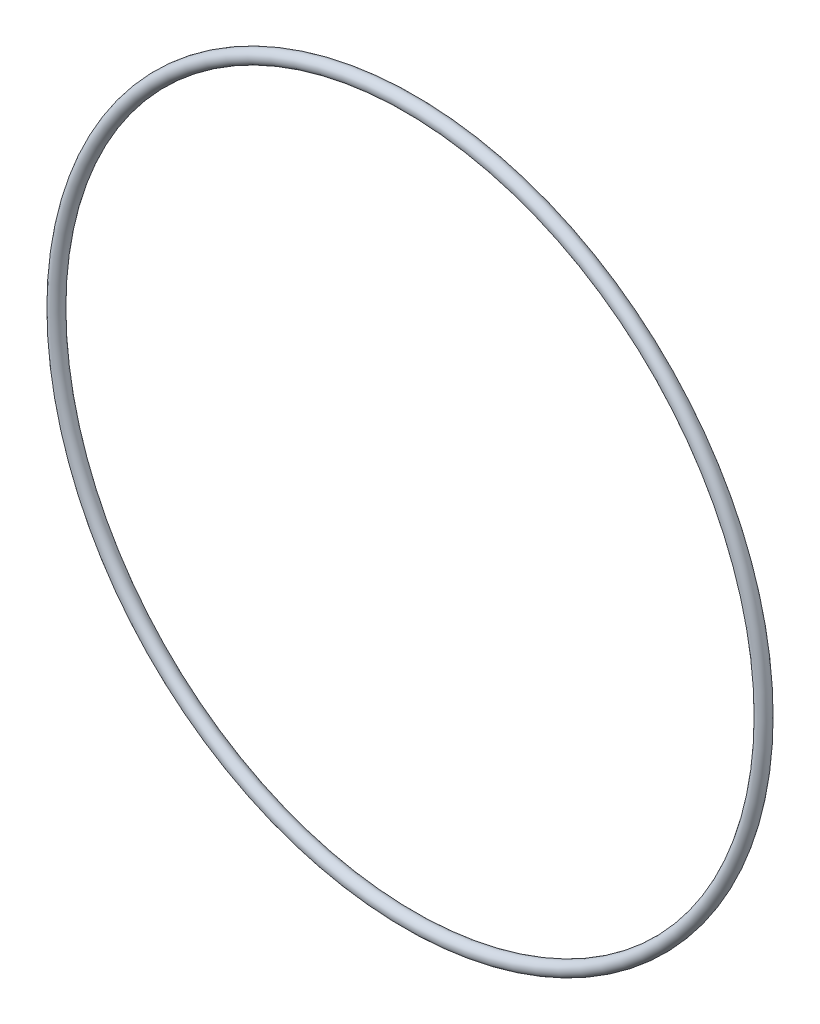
ISO-10303-21;
HEADER;
FILE_DESCRIPTION(('STEP AP214'),'2;1');
FILE_NAME('part.step','',(''),(''),'','','');
FILE_SCHEMA(('AUTOMOTIVE_DESIGN { 1 0 10303 214 1 1 1 1 }'));
ENDSEC;
DATA;
#1=APPLICATION_CONTEXT('core data for automotive mechanical design processes');
#2=APPLICATION_PROTOCOL_DEFINITION('international standard','automotive_design',2000,#1);
#3=PRODUCT_CONTEXT('',#1,'mechanical');
#4=PRODUCT('Part','Part','',(#3));
#5=PRODUCT_RELATED_PRODUCT_CATEGORY('part','',(#4));
#6=PRODUCT_DEFINITION_FORMATION('','',#4);
#7=PRODUCT_DEFINITION_CONTEXT('part definition',#1,'design');
#8=PRODUCT_DEFINITION('design','',#6,#7);
#9=PRODUCT_DEFINITION_SHAPE('','',#8);
#10=(LENGTH_UNIT() NAMED_UNIT(*) SI_UNIT(.MILLI.,.METRE.));
#11=(NAMED_UNIT(*) PLANE_ANGLE_UNIT() SI_UNIT($,.RADIAN.));
#12=(NAMED_UNIT(*) SI_UNIT($,.STERADIAN.) SOLID_ANGLE_UNIT());
#13=UNCERTAINTY_MEASURE_WITH_UNIT(LENGTH_MEASURE(1.E-05),#10,'distance_accuracy_value','');
#14=(GEOMETRIC_REPRESENTATION_CONTEXT(3) GLOBAL_UNCERTAINTY_ASSIGNED_CONTEXT((#13)) GLOBAL_UNIT_ASSIGNED_CONTEXT((#10,
#11,#12)) REPRESENTATION_CONTEXT('',''));
#15=CARTESIAN_POINT('',(0.,0.,0.));
#16=DIRECTION('',(0.,0.,1.));
#17=DIRECTION('',(1.,0.,0.));
#18=AXIS2_PLACEMENT_3D('',#15,#16,#17);
#19=CARTESIAN_POINT('',(0.,0.,0.));
#20=DIRECTION('',(0.,0.,-1.));
#21=DIRECTION('',(-1.,0.,0.));
#22=AXIS2_PLACEMENT_3D('',#19,#20,#21);
#23=TOROIDAL_SURFACE('',#22,83.47075,1.5875);
#24=CARTESIAN_POINT('',(-85.05825,0.,0.));
#25=VERTEX_POINT('',#24);
#26=VERTEX_LOOP('',#25);
#27=FACE_BOUND('',#26,.T.);
#28=ADVANCED_FACE('F24',(#27),#23,.T.);
#29=CLOSED_SHELL('',(#28));
#30=MANIFOLD_SOLID_BREP('B2',#29);
#31=ADVANCED_BREP_SHAPE_REPRESENTATION('',(#18,#30),#14);
#32=SHAPE_DEFINITION_REPRESENTATION(#9,#31);
ENDSEC;
END-ISO-10303-21;
